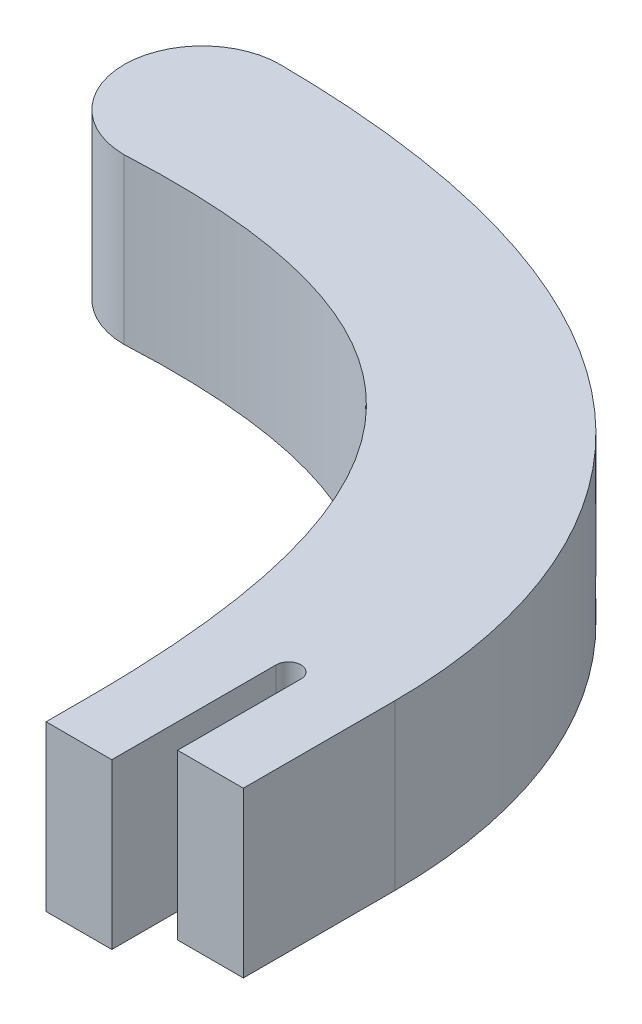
ISO-10303-21;
HEADER;
FILE_DESCRIPTION(('STEP AP214'),'2;1');
FILE_NAME('part.step','',(''),(''),'','','');
FILE_SCHEMA(('AUTOMOTIVE_DESIGN { 1 0 10303 214 1 1 1 1 }'));
ENDSEC;
DATA;
#1=APPLICATION_CONTEXT('core data for automotive mechanical design processes');
#2=APPLICATION_PROTOCOL_DEFINITION('international standard','automotive_design',2000,#1);
#3=PRODUCT_CONTEXT('',#1,'mechanical');
#4=PRODUCT('Part','Part','',(#3));
#5=PRODUCT_RELATED_PRODUCT_CATEGORY('part','',(#4));
#6=PRODUCT_DEFINITION_FORMATION('','',#4);
#7=PRODUCT_DEFINITION_CONTEXT('part definition',#1,'design');
#8=PRODUCT_DEFINITION('design','',#6,#7);
#9=PRODUCT_DEFINITION_SHAPE('','',#8);
#10=(LENGTH_UNIT() NAMED_UNIT(*) SI_UNIT(.MILLI.,.METRE.));
#11=(NAMED_UNIT(*) PLANE_ANGLE_UNIT() SI_UNIT($,.RADIAN.));
#12=(NAMED_UNIT(*) SI_UNIT($,.STERADIAN.) SOLID_ANGLE_UNIT());
#13=UNCERTAINTY_MEASURE_WITH_UNIT(LENGTH_MEASURE(1.E-05),#10,'distance_accuracy_value','');
#14=(GEOMETRIC_REPRESENTATION_CONTEXT(3) GLOBAL_UNCERTAINTY_ASSIGNED_CONTEXT((#13)) GLOBAL_UNIT_ASSIGNED_CONTEXT((#10,
#11,#12)) REPRESENTATION_CONTEXT('',''));
#15=CARTESIAN_POINT('',(0.,0.,0.));
#16=DIRECTION('',(0.,0.,1.));
#17=DIRECTION('',(1.,0.,0.));
#18=AXIS2_PLACEMENT_3D('',#15,#16,#17);
#19=CARTESIAN_POINT('',(0.,20.,0.));
#20=DIRECTION('',(0.,-1.,0.));
#21=DIRECTION('',(0.,0.,-1.));
#22=AXIS2_PLACEMENT_3D('',#19,#20,#21);
#23=CYLINDRICAL_SURFACE('',#22,8.1);
#24=CARTESIAN_POINT('',(0.,0.,0.));
#25=DIRECTION('',(0.,1.,0.));
#26=DIRECTION('',(0.,0.,1.));
#27=AXIS2_PLACEMENT_3D('',#24,#25,#26);
#28=CIRCLE('',#27,8.1);
#29=CARTESIAN_POINT('',(0.,0.,8.1));
#30=VERTEX_POINT('',#29);
#31=EDGE_CURVE('E151',#30,#30,#28,.T.);
#32=ORIENTED_EDGE('',*,*,#31,.F.);
#33=EDGE_LOOP('',(#32));
#34=FACE_BOUND('',#33,.T.);
#35=CARTESIAN_POINT('',(0.,18.,0.));
#36=DIRECTION('',(0.,1.,0.));
#37=DIRECTION('',(0.,0.,1.));
#38=AXIS2_PLACEMENT_3D('',#35,#36,#37);
#39=CIRCLE('',#38,8.1);
#40=CARTESIAN_POINT('',(0.,18.,8.1));
#41=VERTEX_POINT('',#40);
#42=EDGE_CURVE('E351',#41,#41,#39,.T.);
#43=ORIENTED_EDGE('',*,*,#42,.T.);
#44=EDGE_LOOP('',(#43));
#45=FACE_BOUND('',#44,.T.);
#46=ADVANCED_FACE('F35',(#34,#45),#23,.F.);
#47=CARTESIAN_POINT('',(58.4816607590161,20.,10.5829400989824));
#48=DIRECTION('',(0.,-1.,0.));
#49=DIRECTION('',(0.,0.,-1.));
#50=AXIS2_PLACEMENT_3D('',#47,#48,#49);
#51=PLANE('',#50);
#52=CARTESIAN_POINT('',(74.0037175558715,20.,50.5402040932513));
#53=CARTESIAN_POINT('',(74.0037175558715,20.,23.6175330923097));
#54=CARTESIAN_POINT('',(57.2794719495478,20.,-9.07642752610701));
#55=CARTESIAN_POINT('',(-3.58339174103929E-13,20.,-9.50000000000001));
#56=B_SPLINE_CURVE_WITH_KNOTS('',3,(#52,#53,#54,#55),.UNSPECIFIED.,.F.,.F.,(4,4),(0.,1.),.UNSPECIFIED.);
#57=CARTESIAN_POINT('',(74.0037175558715,20.,50.5402040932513));
#58=VERTEX_POINT('',#57);
#59=CARTESIAN_POINT('',(0.,20.,-9.5));
#60=VERTEX_POINT('',#59);
#61=EDGE_CURVE('E174',#58,#60,#56,.T.);
#62=ORIENTED_EDGE('',*,*,#61,.T.);
#63=CARTESIAN_POINT('',(0.,20.,0.));
#64=DIRECTION('',(0.,1.,0.));
#65=DIRECTION('',(0.,0.,1.));
#66=AXIS2_PLACEMENT_3D('',#63,#64,#65);
#67=CIRCLE('',#66,9.5);
#68=CARTESIAN_POINT('',(0.,20.,9.5));
#69=VERTEX_POINT('',#68);
#70=EDGE_CURVE('E102',#60,#69,#67,.T.);
#71=ORIENTED_EDGE('',*,*,#70,.T.);
#72=CARTESIAN_POINT('',(0.,20.,9.5));
#73=CARTESIAN_POINT('',(39.0098476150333,20.,7.48813101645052));
#74=CARTESIAN_POINT('',(55.0000000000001,20.,25.5274489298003));
#75=CARTESIAN_POINT('',(55.,20.,69.0000000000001));
#76=B_SPLINE_CURVE_WITH_KNOTS('',3,(#72,#73,#74,#75),.UNSPECIFIED.,.F.,.F.,(4,4),(0.,1.),.UNSPECIFIED.);
#77=CARTESIAN_POINT('',(55.,20.,69.0000000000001));
#78=VERTEX_POINT('',#77);
#79=EDGE_CURVE('E195',#69,#78,#76,.T.);
#80=ORIENTED_EDGE('',*,*,#79,.T.);
#81=DIRECTION('',(0.,0.,1.));
#82=VECTOR('',#81,1.);
#83=CARTESIAN_POINT('',(55.,20.,69.));
#84=LINE('',#83,#82);
#85=CARTESIAN_POINT('',(55.,20.,74.));
#86=VERTEX_POINT('',#85);
#87=EDGE_CURVE('E214',#78,#86,#84,.T.);
#88=ORIENTED_EDGE('',*,*,#87,.T.);
#89=DIRECTION('',(1.,0.,0.));
#90=VECTOR('',#89,1.);
#91=CARTESIAN_POINT('',(55.,20.,74.));
#92=LINE('',#91,#90);
#93=CARTESIAN_POINT('',(63.,20.,74.));
#94=VERTEX_POINT('',#93);
#95=EDGE_CURVE('E211',#86,#94,#92,.T.);
#96=ORIENTED_EDGE('',*,*,#95,.T.);
#97=DIRECTION('',(0.,0.,-1.));
#98=VECTOR('',#97,1.);
#99=CARTESIAN_POINT('',(63.,20.,74.));
#100=LINE('',#99,#98);
#101=CARTESIAN_POINT('',(63.,20.,54.));
#102=VERTEX_POINT('',#101);
#103=EDGE_CURVE('E213',#94,#102,#100,.T.);
#104=ORIENTED_EDGE('',*,*,#103,.T.);
#105=CARTESIAN_POINT('',(64.5018587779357,20.,54.));
#106=DIRECTION('',(0.,-1.,0.));
#107=DIRECTION('',(0.,0.,-1.));
#108=AXIS2_PLACEMENT_3D('',#105,#106,#107);
#109=CIRCLE('',#108,1.50185877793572);
#110=CARTESIAN_POINT('',(66.0037175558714,20.,54.));
#111=VERTEX_POINT('',#110);
#112=EDGE_CURVE('E127',#102,#111,#109,.T.);
#113=ORIENTED_EDGE('',*,*,#112,.T.);
#114=DIRECTION('',(0.,0.,1.));
#115=VECTOR('',#114,1.);
#116=CARTESIAN_POINT('',(66.0037175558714,20.,54.));
#117=LINE('',#116,#115);
#118=CARTESIAN_POINT('',(66.0037175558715,20.,68.9993007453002));
#119=VERTEX_POINT('',#118);
#120=EDGE_CURVE('E121',#111,#119,#117,.T.);
#121=ORIENTED_EDGE('',*,*,#120,.T.);
#122=DIRECTION('',(1.,0.,0.));
#123=VECTOR('',#122,1.);
#124=CARTESIAN_POINT('',(66.0037175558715,20.,68.9993007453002));
#125=LINE('',#124,#123);
#126=CARTESIAN_POINT('',(74.0037175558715,20.,68.9993007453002));
#127=VERTEX_POINT('',#126);
#128=EDGE_CURVE('E125',#119,#127,#125,.T.);
#129=ORIENTED_EDGE('',*,*,#128,.T.);
#130=DIRECTION('',(0.,0.,-1.));
#131=VECTOR('',#130,1.);
#132=CARTESIAN_POINT('',(74.0037175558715,20.,68.9993007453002));
#133=LINE('',#132,#131);
#134=EDGE_CURVE('E53',#127,#58,#133,.T.);
#135=ORIENTED_EDGE('',*,*,#134,.T.);
#136=EDGE_LOOP('',(#62,#71,#80,#88,#96,#104,#113,#121,#129,#135));
#137=FACE_BOUND('',#136,.T.);
#138=ADVANCED_FACE('F123',(#137),#51,.F.);
#139=CARTESIAN_POINT('',(58.4816607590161,0.,10.5829400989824));
#140=DIRECTION('',(0.,-1.,0.));
#141=DIRECTION('',(0.,0.,-1.));
#142=AXIS2_PLACEMENT_3D('',#139,#140,#141);
#143=PLANE('',#142);
#144=CARTESIAN_POINT('',(74.0037175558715,0.,50.5402040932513));
#145=CARTESIAN_POINT('',(74.0037175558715,0.,23.6175330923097));
#146=CARTESIAN_POINT('',(57.2794719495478,0.,-9.07642752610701));
#147=CARTESIAN_POINT('',(-3.58339174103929E-13,0.,-9.50000000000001));
#148=B_SPLINE_CURVE_WITH_KNOTS('',3,(#144,#145,#146,#147),.UNSPECIFIED.,.F.,.F.,(4,4),(0.,1.),.UNSPECIFIED.);
#149=CARTESIAN_POINT('',(74.0037175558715,0.,50.5402040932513));
#150=VERTEX_POINT('',#149);
#151=CARTESIAN_POINT('',(0.,0.,-9.5));
#152=VERTEX_POINT('',#151);
#153=EDGE_CURVE('E145',#150,#152,#148,.T.);
#154=ORIENTED_EDGE('',*,*,#153,.F.);
#155=DIRECTION('',(0.,0.,-1.));
#156=VECTOR('',#155,1.);
#157=CARTESIAN_POINT('',(74.0037175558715,0.,68.9993007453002));
#158=LINE('',#157,#156);
#159=CARTESIAN_POINT('',(74.0037175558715,0.,68.9993007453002));
#160=VERTEX_POINT('',#159);
#161=EDGE_CURVE('E94',#160,#150,#158,.T.);
#162=ORIENTED_EDGE('',*,*,#161,.F.);
#163=DIRECTION('',(1.,0.,0.));
#164=VECTOR('',#163,1.);
#165=CARTESIAN_POINT('',(66.0037175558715,0.,68.9993007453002));
#166=LINE('',#165,#164);
#167=CARTESIAN_POINT('',(66.0037175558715,0.,68.9993007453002));
#168=VERTEX_POINT('',#167);
#169=EDGE_CURVE('E88',#168,#160,#166,.T.);
#170=ORIENTED_EDGE('',*,*,#169,.F.);
#171=DIRECTION('',(0.,0.,1.));
#172=VECTOR('',#171,1.);
#173=CARTESIAN_POINT('',(66.0037175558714,0.,54.));
#174=LINE('',#173,#172);
#175=CARTESIAN_POINT('',(66.0037175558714,0.,54.));
#176=VERTEX_POINT('',#175);
#177=EDGE_CURVE('E135',#176,#168,#174,.T.);
#178=ORIENTED_EDGE('',*,*,#177,.F.);
#179=CARTESIAN_POINT('',(64.5018587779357,0.,54.));
#180=DIRECTION('',(0.,-1.,0.));
#181=DIRECTION('',(0.,0.,-1.));
#182=AXIS2_PLACEMENT_3D('',#179,#180,#181);
#183=CIRCLE('',#182,1.50185877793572);
#184=CARTESIAN_POINT('',(63.,0.,54.));
#185=VERTEX_POINT('',#184);
#186=EDGE_CURVE('E169',#185,#176,#183,.T.);
#187=ORIENTED_EDGE('',*,*,#186,.F.);
#188=DIRECTION('',(0.,0.,-1.));
#189=VECTOR('',#188,1.);
#190=CARTESIAN_POINT('',(63.,0.,74.));
#191=LINE('',#190,#189);
#192=CARTESIAN_POINT('',(63.,0.,74.));
#193=VERTEX_POINT('',#192);
#194=EDGE_CURVE('E167',#193,#185,#191,.T.);
#195=ORIENTED_EDGE('',*,*,#194,.F.);
#196=DIRECTION('',(1.,0.,0.));
#197=VECTOR('',#196,1.);
#198=CARTESIAN_POINT('',(55.,0.,74.));
#199=LINE('',#198,#197);
#200=CARTESIAN_POINT('',(55.,0.,74.));
#201=VERTEX_POINT('',#200);
#202=EDGE_CURVE('E165',#201,#193,#199,.T.);
#203=ORIENTED_EDGE('',*,*,#202,.F.);
#204=DIRECTION('',(0.,0.,1.));
#205=VECTOR('',#204,1.);
#206=CARTESIAN_POINT('',(55.,0.,69.));
#207=LINE('',#206,#205);
#208=CARTESIAN_POINT('',(55.,0.,69.0000000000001));
#209=VERTEX_POINT('',#208);
#210=EDGE_CURVE('E160',#209,#201,#207,.T.);
#211=ORIENTED_EDGE('',*,*,#210,.F.);
#212=CARTESIAN_POINT('',(0.,0.,9.5));
#213=CARTESIAN_POINT('',(39.0098476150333,0.,7.48813101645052));
#214=CARTESIAN_POINT('',(55.0000000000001,0.,25.5274489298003));
#215=CARTESIAN_POINT('',(55.,0.,69.0000000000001));
#216=B_SPLINE_CURVE_WITH_KNOTS('',3,(#212,#213,#214,#215),.UNSPECIFIED.,.F.,.F.,(4,4),(0.,1.),.UNSPECIFIED.);
#217=CARTESIAN_POINT('',(0.,0.,9.5));
#218=VERTEX_POINT('',#217);
#219=EDGE_CURVE('E156',#218,#209,#216,.T.);
#220=ORIENTED_EDGE('',*,*,#219,.F.);
#221=CARTESIAN_POINT('',(0.,0.,0.));
#222=DIRECTION('',(0.,1.,0.));
#223=DIRECTION('',(0.,0.,1.));
#224=AXIS2_PLACEMENT_3D('',#221,#222,#223);
#225=CIRCLE('',#224,9.5);
#226=EDGE_CURVE('E150',#152,#218,#225,.T.);
#227=ORIENTED_EDGE('',*,*,#226,.F.);
#228=EDGE_LOOP('',(#154,#162,#170,#178,#187,#195,#203,#211,#220,#227));
#229=FACE_BOUND('',#228,.T.);
#230=ORIENTED_EDGE('',*,*,#31,.T.);
#231=EDGE_LOOP('',(#230));
#232=FACE_BOUND('',#231,.T.);
#233=ADVANCED_FACE('F199',(#229,#232),#143,.T.);
#234=DIRECTION('',(0.,-1.,0.));
#235=VECTOR('',#234,1.);
#236=SURFACE_OF_LINEAR_EXTRUSION('',#56,#235);
#237=ORIENTED_EDGE('',*,*,#153,.T.);
#238=DIRECTION('',(0.,-1.,0.));
#239=VECTOR('',#238,1.);
#240=CARTESIAN_POINT('',(0.,20.,-9.5));
#241=LINE('',#240,#239);
#242=EDGE_CURVE('E11',#60,#152,#241,.T.);
#243=ORIENTED_EDGE('',*,*,#242,.F.);
#244=ORIENTED_EDGE('',*,*,#61,.F.);
#245=DIRECTION('',(0.,-1.,0.));
#246=VECTOR('',#245,1.);
#247=CARTESIAN_POINT('',(74.0037175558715,20.,50.5402040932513));
#248=LINE('',#247,#246);
#249=EDGE_CURVE('E141',#58,#150,#248,.T.);
#250=ORIENTED_EDGE('',*,*,#249,.T.);
#251=EDGE_LOOP('',(#237,#243,#244,#250));
#252=FACE_BOUND('',#251,.T.);
#253=ADVANCED_FACE('F37',(#252),#236,.F.);
#254=CARTESIAN_POINT('',(0.,20.,0.));
#255=DIRECTION('',(0.,-1.,0.));
#256=DIRECTION('',(0.,0.,-1.));
#257=AXIS2_PLACEMENT_3D('',#254,#255,#256);
#258=CYLINDRICAL_SURFACE('',#257,9.5);
#259=ORIENTED_EDGE('',*,*,#226,.T.);
#260=DIRECTION('',(0.,-1.,0.));
#261=VECTOR('',#260,1.);
#262=CARTESIAN_POINT('',(0.,20.,9.5));
#263=LINE('',#262,#261);
#264=EDGE_CURVE('E45',#69,#218,#263,.T.);
#265=ORIENTED_EDGE('',*,*,#264,.F.);
#266=ORIENTED_EDGE('',*,*,#70,.F.);
#267=ORIENTED_EDGE('',*,*,#242,.T.);
#268=EDGE_LOOP('',(#259,#265,#266,#267));
#269=FACE_BOUND('',#268,.T.);
#270=ADVANCED_FACE('F229',(#269),#258,.T.);
#271=DIRECTION('',(0.,-1.,0.));
#272=VECTOR('',#271,1.);
#273=SURFACE_OF_LINEAR_EXTRUSION('',#76,#272);
#274=ORIENTED_EDGE('',*,*,#219,.T.);
#275=DIRECTION('',(0.,-1.,0.));
#276=VECTOR('',#275,1.);
#277=CARTESIAN_POINT('',(55.,20.,69.0000000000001));
#278=LINE('',#277,#276);
#279=EDGE_CURVE('E187',#78,#209,#278,.T.);
#280=ORIENTED_EDGE('',*,*,#279,.F.);
#281=ORIENTED_EDGE('',*,*,#79,.F.);
#282=ORIENTED_EDGE('',*,*,#264,.T.);
#283=EDGE_LOOP('',(#274,#280,#281,#282));
#284=FACE_BOUND('',#283,.T.);
#285=ADVANCED_FACE('F193',(#284),#273,.F.);
#286=CARTESIAN_POINT('',(55.,20.,69.));
#287=DIRECTION('',(1.,0.,0.));
#288=DIRECTION('',(0.,0.,-1.));
#289=AXIS2_PLACEMENT_3D('',#286,#287,#288);
#290=PLANE('',#289);
#291=ORIENTED_EDGE('',*,*,#210,.T.);
#292=DIRECTION('',(0.,-1.,0.));
#293=VECTOR('',#292,1.);
#294=CARTESIAN_POINT('',(55.,20.,74.));
#295=LINE('',#294,#293);
#296=EDGE_CURVE('E184',#86,#201,#295,.T.);
#297=ORIENTED_EDGE('',*,*,#296,.F.);
#298=ORIENTED_EDGE('',*,*,#87,.F.);
#299=ORIENTED_EDGE('',*,*,#279,.T.);
#300=EDGE_LOOP('',(#291,#297,#298,#299));
#301=FACE_BOUND('',#300,.T.);
#302=ADVANCED_FACE('F205',(#301),#290,.F.);
#303=CARTESIAN_POINT('',(55.,20.,74.));
#304=DIRECTION('',(0.,0.,-1.));
#305=DIRECTION('',(-1.,0.,0.));
#306=AXIS2_PLACEMENT_3D('',#303,#304,#305);
#307=PLANE('',#306);
#308=ORIENTED_EDGE('',*,*,#202,.T.);
#309=DIRECTION('',(0.,-1.,0.));
#310=VECTOR('',#309,1.);
#311=CARTESIAN_POINT('',(63.,20.,74.));
#312=LINE('',#311,#310);
#313=EDGE_CURVE('E181',#94,#193,#312,.T.);
#314=ORIENTED_EDGE('',*,*,#313,.F.);
#315=ORIENTED_EDGE('',*,*,#95,.F.);
#316=ORIENTED_EDGE('',*,*,#296,.T.);
#317=EDGE_LOOP('',(#308,#314,#315,#316));
#318=FACE_BOUND('',#317,.T.);
#319=ADVANCED_FACE('F209',(#318),#307,.F.);
#320=CARTESIAN_POINT('',(63.,20.,74.));
#321=DIRECTION('',(-1.,0.,0.));
#322=DIRECTION('',(0.,0.,1.));
#323=AXIS2_PLACEMENT_3D('',#320,#321,#322);
#324=PLANE('',#323);
#325=ORIENTED_EDGE('',*,*,#194,.T.);
#326=DIRECTION('',(0.,-1.,0.));
#327=VECTOR('',#326,1.);
#328=CARTESIAN_POINT('',(63.,20.,54.));
#329=LINE('',#328,#327);
#330=EDGE_CURVE('E178',#102,#185,#329,.T.);
#331=ORIENTED_EDGE('',*,*,#330,.F.);
#332=ORIENTED_EDGE('',*,*,#103,.F.);
#333=ORIENTED_EDGE('',*,*,#313,.T.);
#334=EDGE_LOOP('',(#325,#331,#332,#333));
#335=FACE_BOUND('',#334,.T.);
#336=ADVANCED_FACE('F260',(#335),#324,.F.);
#337=CARTESIAN_POINT('',(64.5018587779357,20.,54.));
#338=DIRECTION('',(0.,-1.,0.));
#339=DIRECTION('',(0.,0.,-1.));
#340=AXIS2_PLACEMENT_3D('',#337,#338,#339);
#341=CYLINDRICAL_SURFACE('',#340,1.50185877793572);
#342=ORIENTED_EDGE('',*,*,#186,.T.);
#343=DIRECTION('',(0.,-1.,0.));
#344=VECTOR('',#343,1.);
#345=CARTESIAN_POINT('',(66.0037175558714,20.,54.));
#346=LINE('',#345,#344);
#347=EDGE_CURVE('E136',#111,#176,#346,.T.);
#348=ORIENTED_EDGE('',*,*,#347,.F.);
#349=ORIENTED_EDGE('',*,*,#112,.F.);
#350=ORIENTED_EDGE('',*,*,#330,.T.);
#351=EDGE_LOOP('',(#342,#348,#349,#350));
#352=FACE_BOUND('',#351,.T.);
#353=ADVANCED_FACE('F257',(#352),#341,.F.);
#354=CARTESIAN_POINT('',(66.0037175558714,20.,54.));
#355=DIRECTION('',(1.,0.,0.));
#356=DIRECTION('',(0.,0.,-1.));
#357=AXIS2_PLACEMENT_3D('',#354,#355,#356);
#358=PLANE('',#357);
#359=ORIENTED_EDGE('',*,*,#177,.T.);
#360=DIRECTION('',(0.,-1.,0.));
#361=VECTOR('',#360,1.);
#362=CARTESIAN_POINT('',(66.0037175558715,20.,68.9993007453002));
#363=LINE('',#362,#361);
#364=EDGE_CURVE('E132',#119,#168,#363,.T.);
#365=ORIENTED_EDGE('',*,*,#364,.F.);
#366=ORIENTED_EDGE('',*,*,#120,.F.);
#367=ORIENTED_EDGE('',*,*,#347,.T.);
#368=EDGE_LOOP('',(#359,#365,#366,#367));
#369=FACE_BOUND('',#368,.T.);
#370=ADVANCED_FACE('F133',(#369),#358,.F.);
#371=CARTESIAN_POINT('',(66.0037175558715,20.,68.9993007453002));
#372=DIRECTION('',(0.,0.,-1.));
#373=DIRECTION('',(-1.,0.,0.));
#374=AXIS2_PLACEMENT_3D('',#371,#372,#373);
#375=PLANE('',#374);
#376=ORIENTED_EDGE('',*,*,#169,.T.);
#377=DIRECTION('',(0.,-1.,0.));
#378=VECTOR('',#377,1.);
#379=CARTESIAN_POINT('',(74.0037175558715,20.,68.9993007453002));
#380=LINE('',#379,#378);
#381=EDGE_CURVE('E137',#127,#160,#380,.T.);
#382=ORIENTED_EDGE('',*,*,#381,.F.);
#383=ORIENTED_EDGE('',*,*,#128,.F.);
#384=ORIENTED_EDGE('',*,*,#364,.T.);
#385=EDGE_LOOP('',(#376,#382,#383,#384));
#386=FACE_BOUND('',#385,.T.);
#387=ADVANCED_FACE('F139',(#386),#375,.F.);
#388=CARTESIAN_POINT('',(74.0037175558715,20.,68.9993007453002));
#389=DIRECTION('',(-1.,0.,0.));
#390=DIRECTION('',(0.,0.,1.));
#391=AXIS2_PLACEMENT_3D('',#388,#389,#390);
#392=PLANE('',#391);
#393=ORIENTED_EDGE('',*,*,#161,.T.);
#394=ORIENTED_EDGE('',*,*,#249,.F.);
#395=ORIENTED_EDGE('',*,*,#134,.F.);
#396=ORIENTED_EDGE('',*,*,#381,.T.);
#397=EDGE_LOOP('',(#393,#394,#395,#396));
#398=FACE_BOUND('',#397,.T.);
#399=ADVANCED_FACE('F250',(#398),#392,.F.);
#400=CARTESIAN_POINT('',(0.,18.,0.));
#401=DIRECTION('',(0.,1.,0.));
#402=DIRECTION('',(0.,0.,1.));
#403=AXIS2_PLACEMENT_3D('',#400,#401,#402);
#404=PLANE('',#403);
#405=ORIENTED_EDGE('',*,*,#42,.F.);
#406=EDGE_LOOP('',(#405));
#407=FACE_BOUND('',#406,.T.);
#408=ADVANCED_FACE('F246',(#407),#404,.F.);
#409=CLOSED_SHELL('',(#46,#138,#233,#253,#270,#285,#302,#319,#336,#353,#370,#387,#399,#408));
#410=MANIFOLD_SOLID_BREP('B2',#409);
#411=ADVANCED_BREP_SHAPE_REPRESENTATION('',(#18,#410),#14);
#412=SHAPE_DEFINITION_REPRESENTATION(#9,#411);
ENDSEC;
END-ISO-10303-21;
